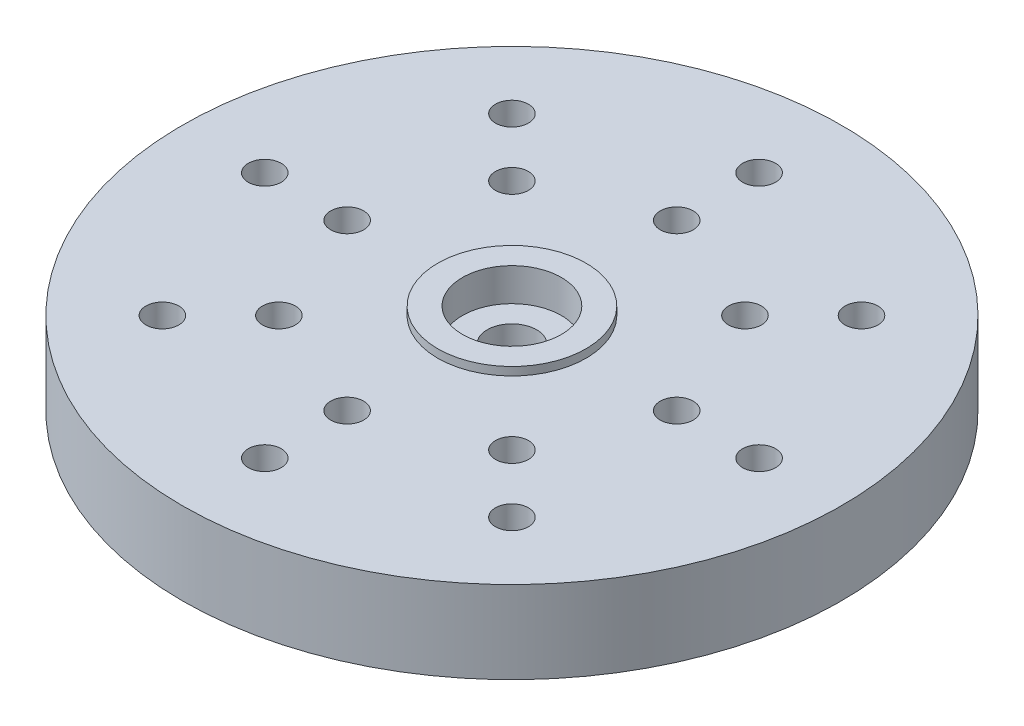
from build123d import *

# Parameters (mm, degrees)
SKETCH1_R                = 20
BOSS_EXTRUDE1_DEPTH      = 5
SKETCH3_R                = 1
CUT_EXTRUDE2_DEPTH       = 10
CIRPATTERN1_COUNT        = 8
SKETCH5_R                = 6
BOSS_EXTRUDE3_DEPTH      = 3
CUT_EXTRUDE5_DEPTH       = 30.393876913
BOSS_EXTRUDE4_DEPTH      = 0.5
BOSS_EXTRUDE4_DEPTH_BACK = 4.96
SKETCH4_R                = 4.5
SKETCH10_R               = 3
CUT_EXTRUDE6_DEPTH       = 2
SKETCH11_R               = 1.5
CUT_EXTRUDE7_DEPTH       = 30.021543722


with BuildPart() as part:
    # Sketch1 → Boss-Extrude1 (new body)
    with BuildSketch(Plane(origin=(0, 0, 0), x_dir=(1, 0, 0), z_dir=(0, 1, 0))):
        with Locations(Location((0, 0, 0), (0, 0, 270))):
            Circle(SKETCH1_R)
    extrude(amount=BOSS_EXTRUDE1_DEPTH)

    # Sketch3 → Cut-Extrude2 (cut)
    with BuildSketch(Plane(origin=(0, 5, 0), x_dir=(1, 0, 0), z_dir=(0, 1, 0))):
        with Locations(Location((0, 15, 0), (0, 0, 270))):
            Circle(SKETCH3_R)
        with Locations(Location((0, 10, 0), (0, 0, 270))):
            Circle(SKETCH3_R)
    cut_extrude2 = extrude(amount=-CUT_EXTRUDE2_DEPTH, mode=Mode.SUBTRACT)

    # CirPattern1: Cut-Extrude2 ×8 about axis
    cirpattern1_axis = Axis((0, 0, 0), (0, 1, 0))
    for i in range(1, CIRPATTERN1_COUNT):
        add(cut_extrude2.rotate(cirpattern1_axis, i * 360 / CIRPATTERN1_COUNT), mode=Mode.SUBTRACT)

    # Sketch5 → Boss-Extrude3 (add)
    with BuildSketch(Plane.XZ):
        with Locations(Location((0, 0, 0), (0, 0, 90))):
            Circle(SKETCH5_R)
    extrude(amount=BOSS_EXTRUDE3_DEPTH)

    # Sketch8 → Cut-Extrude5 (cut, through all)
    with BuildSketch(Plane.XZ.offset(3)):
        with BuildLine():
            Line((0.7, 3.684087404), (0, 3.05))
            Line((0, 3.05), (-0.7, 3.684087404))
            ThreePointArc((-0.7, 3.684087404), (-0.779668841, 3.668053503), (-0.858971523, 3.650296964))
            Line((-0.858971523, 3.650296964), (-1.240546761, 2.786313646))
            Line((-1.240546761, 2.786313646), (-2.137935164, 3.080865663))
            ThreePointArc((-2.137935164, 3.080865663), (-2.204194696, 3.033813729), (-2.269419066, 2.985337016))
            Line((-2.269419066, 2.985337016), (-2.266591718, 2.040848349))
            Line((-2.266591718, 2.040848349), (-3.206201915, 1.944934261))
            ThreePointArc((-3.206201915, 1.944934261), (-3.247595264, 1.875), (-3.287463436, 1.804185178))
            Line((-3.287463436, 1.804185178), (-2.900722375, 0.942501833))
            Line((-2.900722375, 0.942501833), (-3.720087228, 0.472706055))
            ThreePointArc((-3.720087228, 0.472706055), (-3.729457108, 0.391981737), (-3.737075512, 0.311073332))
            Line((-3.737075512, 0.311073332), (-3.033291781, -0.318811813))
            Line((-3.033291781, -0.318811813), (-3.590735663, -1.081257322))
            ThreePointArc((-3.590735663, -1.081257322), (-3.566461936, -1.158813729), (-3.540513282, -1.235825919))
            Line((-3.540513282, -1.235825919), (-2.641377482, -1.525))
            Line((-2.641377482, -1.525), (-2.840513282, -2.448261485))
            ThreePointArc((-2.840513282, -2.448261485), (-2.786793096, -2.509239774), (-2.73176414, -2.569039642))
            Line((-2.73176414, -2.569039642), (-1.792745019, -2.467501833))
            Line((-1.792745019, -2.467501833), (-1.599140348, -3.391938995))
            ThreePointArc((-1.599140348, -3.391938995), (-1.525262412, -3.425795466), (-1.450668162, -3.458043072))
            Line((-1.450668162, -3.458043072), (-0.634130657, -2.983350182))
            Line((-0.634130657, -2.983350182), (-0.081261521, -3.749119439))
            ThreePointArc((-0.081261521, -3.749119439), (0, -3.75), (0.081261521, -3.749119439))
            Line((0.081261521, -3.749119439), (0.634130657, -2.983350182))
            Line((0.634130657, -2.983350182), (1.450668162, -3.458043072))
            ThreePointArc((1.450668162, -3.458043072), (1.525262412, -3.425795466), (1.599140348, -3.391938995))
            Line((1.599140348, -3.391938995), (1.792745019, -2.467501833))
            Line((1.792745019, -2.467501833), (2.73176414, -2.569039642))
            ThreePointArc((2.73176414, -2.569039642), (2.786793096, -2.509239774), (2.840513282, -2.448261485))
            Line((2.840513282, -2.448261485), (2.641377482, -1.525))
            Line((2.641377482, -1.525), (3.540513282, -1.235825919))
            ThreePointArc((3.540513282, -1.235825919), (3.566461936, -1.158813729), (3.590735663, -1.081257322))
            Line((3.590735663, -1.081257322), (3.033291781, -0.318811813))
            Line((3.033291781, -0.318811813), (3.737075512, 0.311073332))
            ThreePointArc((3.737075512, 0.311073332), (3.729457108, 0.391981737), (3.720087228, 0.472706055))
            Line((3.720087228, 0.472706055), (2.900722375, 0.942501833))
            Line((2.900722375, 0.942501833), (3.287463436, 1.804185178))
            ThreePointArc((3.287463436, 1.804185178), (3.247595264, 1.875), (3.206201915, 1.944934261))
            Line((3.206201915, 1.944934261), (2.266591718, 2.040848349))
            Line((2.266591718, 2.040848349), (2.269419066, 2.985337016))
            ThreePointArc((2.269419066, 2.985337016), (2.204194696, 3.033813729), (2.137935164, 3.080865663))
            Line((2.137935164, 3.080865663), (1.240546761, 2.786313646))
            Line((1.240546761, 2.786313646), (0.858971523, 3.650296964))
            ThreePointArc((0.858971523, 3.650296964), (0.779668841, 3.668053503), (0.7, 3.684087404))
        make_face()
    extrude(amount=-CUT_EXTRUDE5_DEPTH, mode=Mode.SUBTRACT)

    # Sketch4 → Boss-Extrude4 (add, two sides: drawn at the far end of the back side and taken through both)
    with BuildSketch(Plane(origin=(0, 5, 0), x_dir=(1, 0, 0), z_dir=(0, 1, 0)).offset(-BOSS_EXTRUDE4_DEPTH_BACK)):
        with Locations(Location((0, 0, 0), (0, 0, 270))):
            Circle(SKETCH4_R)
    extrude(amount=BOSS_EXTRUDE4_DEPTH + BOSS_EXTRUDE4_DEPTH_BACK)

    # Sketch10 → Cut-Extrude6 (cut)
    with BuildSketch(Plane(origin=(0, 5.5, 0), x_dir=(1, 0, 0), z_dir=(0, 1, 0))):
        with Locations(Location((0, 0, 0), (0, 0, 270))):
            Circle(SKETCH10_R)
    extrude(amount=-CUT_EXTRUDE6_DEPTH, mode=Mode.SUBTRACT)

    # Sketch11 → Cut-Extrude7 (cut, through all)
    with BuildSketch(Plane(origin=(0, 3.5, 0), x_dir=(1, 0, 0), z_dir=(0, 1, 0))):
        with Locations(Location((0, 0, 0), (0, 0, 270))):
            Circle(SKETCH11_R)
    extrude(amount=-CUT_EXTRUDE7_DEPTH, mode=Mode.SUBTRACT)


solid = part.part
